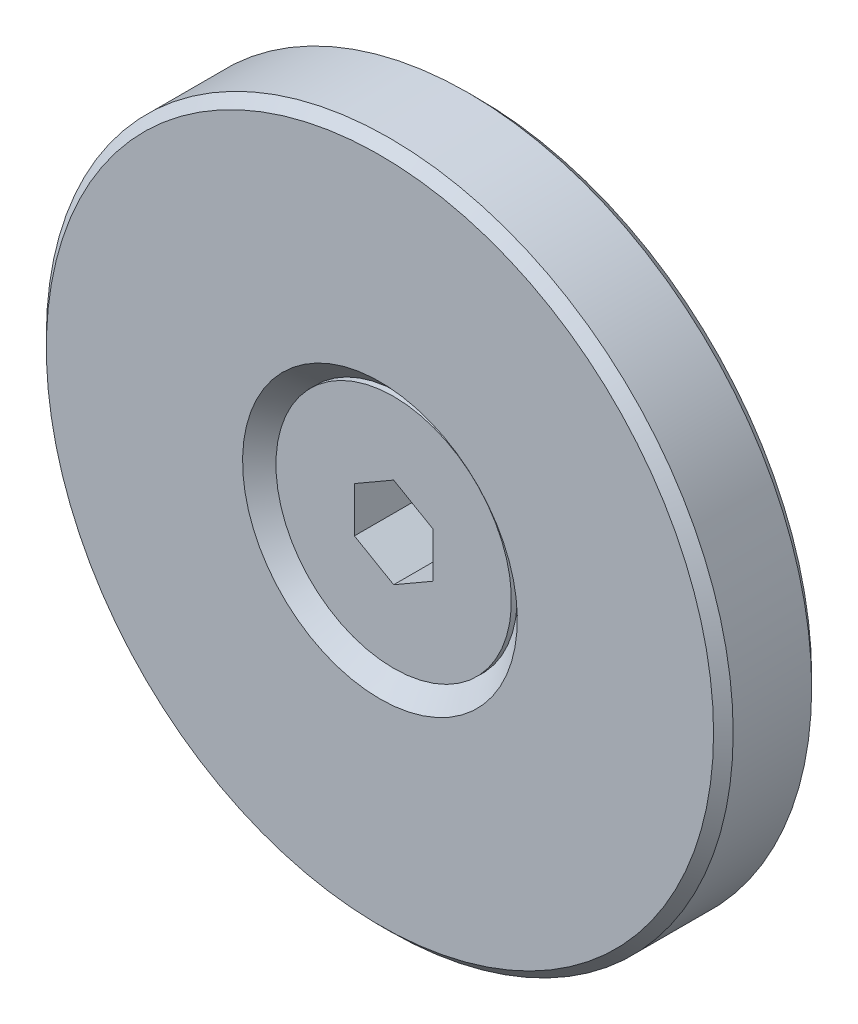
ISO-10303-21;
HEADER;
FILE_DESCRIPTION(('STEP AP214'),'2;1');
FILE_NAME('part.step','',(''),(''),'','','');
FILE_SCHEMA(('AUTOMOTIVE_DESIGN { 1 0 10303 214 1 1 1 1 }'));
ENDSEC;
DATA;
#1=APPLICATION_CONTEXT('core data for automotive mechanical design processes');
#2=APPLICATION_PROTOCOL_DEFINITION('international standard','automotive_design',2000,#1);
#3=PRODUCT_CONTEXT('',#1,'mechanical');
#4=PRODUCT('Part','Part','',(#3));
#5=PRODUCT_RELATED_PRODUCT_CATEGORY('part','',(#4));
#6=PRODUCT_DEFINITION_FORMATION('','',#4);
#7=PRODUCT_DEFINITION_CONTEXT('part definition',#1,'design');
#8=PRODUCT_DEFINITION('design','',#6,#7);
#9=PRODUCT_DEFINITION_SHAPE('','',#8);
#10=(LENGTH_UNIT() NAMED_UNIT(*) SI_UNIT(.MILLI.,.METRE.));
#11=(NAMED_UNIT(*) PLANE_ANGLE_UNIT() SI_UNIT($,.RADIAN.));
#12=(NAMED_UNIT(*) SI_UNIT($,.STERADIAN.) SOLID_ANGLE_UNIT());
#13=UNCERTAINTY_MEASURE_WITH_UNIT(LENGTH_MEASURE(1.E-05),#10,'distance_accuracy_value','');
#14=(GEOMETRIC_REPRESENTATION_CONTEXT(3) GLOBAL_UNCERTAINTY_ASSIGNED_CONTEXT((#13)) GLOBAL_UNIT_ASSIGNED_CONTEXT((#10,
#11,#12)) REPRESENTATION_CONTEXT('',''));
#15=CARTESIAN_POINT('',(0.,0.,0.));
#16=DIRECTION('',(0.,0.,1.));
#17=DIRECTION('',(1.,0.,0.));
#18=AXIS2_PLACEMENT_3D('',#15,#16,#17);
#19=CARTESIAN_POINT('',(0.,2.00000000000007,-7.7));
#20=DIRECTION('',(0.,0.,1.));
#21=DIRECTION('',(0.,-1.,0.));
#22=AXIS2_PLACEMENT_3D('',#19,#20,#21);
#23=PLANE('',#22);
#24=CARTESIAN_POINT('',(0.,0.,-7.7));
#25=DIRECTION('',(0.,0.,1.));
#26=DIRECTION('',(0.,-1.,0.));
#27=AXIS2_PLACEMENT_3D('',#24,#25,#26);
#28=CIRCLE('',#27,2.00000000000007);
#29=CARTESIAN_POINT('',(0.,-2.00000000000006,-7.7));
#30=VERTEX_POINT('',#29);
#31=EDGE_CURVE('E9',#30,#30,#28,.T.);
#32=ORIENTED_EDGE('',*,*,#31,.F.);
#33=EDGE_LOOP('',(#32));
#34=FACE_BOUND('',#33,.T.);
#35=ADVANCED_FACE('F14',(#34),#23,.F.);
#36=CARTESIAN_POINT('',(0.,0.,-7.7));
#37=DIRECTION('',(0.,0.,1.));
#38=DIRECTION('',(0.,-1.,0.));
#39=AXIS2_PLACEMENT_3D('',#36,#37,#38);
#40=CONICAL_SURFACE('',#39,2.00000000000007,0.785398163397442);
#41=CARTESIAN_POINT('',(0.,0.,-6.7));
#42=DIRECTION('',(0.,0.,1.));
#43=DIRECTION('',(0.,-1.,0.));
#44=AXIS2_PLACEMENT_3D('',#41,#42,#43);
#45=CIRCLE('',#44,3.00000000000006);
#46=CARTESIAN_POINT('',(0.,-3.00000000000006,-6.7));
#47=VERTEX_POINT('',#46);
#48=EDGE_CURVE('E21',#47,#47,#45,.T.);
#49=ORIENTED_EDGE('',*,*,#48,.F.);
#50=EDGE_LOOP('',(#49));
#51=FACE_BOUND('',#50,.T.);
#52=ORIENTED_EDGE('',*,*,#31,.T.);
#53=EDGE_LOOP('',(#52));
#54=FACE_BOUND('',#53,.T.);
#55=ADVANCED_FACE('F143',(#51,#54),#40,.T.);
#56=CARTESIAN_POINT('',(0.,0.,10.));
#57=DIRECTION('',(0.,0.,1.));
#58=DIRECTION('',(0.,-1.,0.));
#59=AXIS2_PLACEMENT_3D('',#56,#57,#58);
#60=CYLINDRICAL_SURFACE('',#59,3.00000000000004);
#61=CARTESIAN_POINT('',(0.,0.,1.00000000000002));
#62=DIRECTION('',(0.,0.,1.));
#63=DIRECTION('',(0.,-1.,0.));
#64=AXIS2_PLACEMENT_3D('',#61,#62,#63);
#65=CIRCLE('',#64,3.);
#66=CARTESIAN_POINT('',(0.,-3.,1.00000000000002));
#67=VERTEX_POINT('',#66);
#68=EDGE_CURVE('E136',#67,#67,#65,.T.);
#69=ORIENTED_EDGE('',*,*,#68,.F.);
#70=EDGE_LOOP('',(#69));
#71=FACE_BOUND('',#70,.T.);
#72=ORIENTED_EDGE('',*,*,#48,.T.);
#73=EDGE_LOOP('',(#72));
#74=FACE_BOUND('',#73,.T.);
#75=ADVANCED_FACE('F141',(#71,#74),#60,.T.);
#76=CARTESIAN_POINT('',(0.,0.,1.00000000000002));
#77=DIRECTION('',(0.,0.,1.));
#78=DIRECTION('',(0.,-1.,0.));
#79=AXIS2_PLACEMENT_3D('',#76,#77,#78);
#80=CONICAL_SURFACE('',#79,3.,0.785398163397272);
#81=CARTESIAN_POINT('',(0.,0.,1.19977548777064));
#82=DIRECTION('',(0.,0.,1.));
#83=DIRECTION('',(0.,-1.,0.));
#84=AXIS2_PLACEMENT_3D('',#81,#82,#83);
#85=CIRCLE('',#84,3.19977548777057);
#86=CARTESIAN_POINT('',(0.,-3.19977548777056,1.19977548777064));
#87=VERTEX_POINT('',#86);
#88=EDGE_CURVE('E133',#87,#87,#85,.T.);
#89=ORIENTED_EDGE('',*,*,#88,.F.);
#90=EDGE_LOOP('',(#89));
#91=FACE_BOUND('',#90,.T.);
#92=ORIENTED_EDGE('',*,*,#68,.T.);
#93=EDGE_LOOP('',(#92));
#94=FACE_BOUND('',#93,.T.);
#95=ADVANCED_FACE('F166',(#91,#94),#80,.T.);
#96=CARTESIAN_POINT('',(0.,0.,10.));
#97=DIRECTION('',(0.,0.,1.));
#98=DIRECTION('',(0.,-1.,0.));
#99=AXIS2_PLACEMENT_3D('',#96,#97,#98);
#100=CYLINDRICAL_SURFACE('',#99,3.19977548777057);
#101=CARTESIAN_POINT('',(0.,0.,0.));
#102=DIRECTION('',(0.,0.,1.));
#103=DIRECTION('',(0.,-1.,0.));
#104=AXIS2_PLACEMENT_3D('',#101,#102,#103);
#105=CIRCLE('',#104,3.19977548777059);
#106=CARTESIAN_POINT('',(0.,-3.19977548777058,0.));
#107=VERTEX_POINT('',#106);
#108=EDGE_CURVE('E130',#107,#107,#105,.T.);
#109=ORIENTED_EDGE('',*,*,#108,.F.);
#110=EDGE_LOOP('',(#109));
#111=FACE_BOUND('',#110,.T.);
#112=ORIENTED_EDGE('',*,*,#88,.T.);
#113=EDGE_LOOP('',(#112));
#114=FACE_BOUND('',#113,.T.);
#115=ADVANCED_FACE('F175',(#111,#114),#100,.F.);
#116=CARTESIAN_POINT('',(0.,3.19977548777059,0.));
#117=DIRECTION('',(0.,0.,1.));
#118=DIRECTION('',(0.,-1.,0.));
#119=AXIS2_PLACEMENT_3D('',#116,#117,#118);
#120=PLANE('',#119);
#121=ORIENTED_EDGE('',*,*,#108,.T.);
#122=EDGE_LOOP('',(#121));
#123=FACE_BOUND('',#122,.T.);
#124=CARTESIAN_POINT('',(0.,0.,0.));
#125=DIRECTION('',(0.,0.,1.));
#126=DIRECTION('',(1.,0.,0.));
#127=AXIS2_PLACEMENT_3D('',#124,#125,#126);
#128=CIRCLE('',#127,17.);
#129=CARTESIAN_POINT('',(17.,0.,0.));
#130=VERTEX_POINT('',#129);
#131=EDGE_CURVE('E361',#130,#130,#128,.T.);
#132=ORIENTED_EDGE('',*,*,#131,.F.);
#133=EDGE_LOOP('',(#132));
#134=FACE_BOUND('',#133,.T.);
#135=ADVANCED_FACE('F184',(#123,#134),#120,.F.);
#136=CARTESIAN_POINT('',(0.,0.,4.5000000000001));
#137=DIRECTION('',(0.,0.,-1.));
#138=DIRECTION('',(-1.,0.,0.));
#139=AXIS2_PLACEMENT_3D('',#136,#137,#138);
#140=CONICAL_SURFACE('',#139,17.5,0.785398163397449);
#141=CARTESIAN_POINT('',(0.,0.,5.0000000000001));
#142=DIRECTION('',(0.,0.,1.));
#143=DIRECTION('',(1.,0.,0.));
#144=AXIS2_PLACEMENT_3D('',#141,#142,#143);
#145=CIRCLE('',#144,17.);
#146=CARTESIAN_POINT('',(17.,0.,5.0000000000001));
#147=VERTEX_POINT('',#146);
#148=EDGE_CURVE('E103',#147,#147,#145,.T.);
#149=ORIENTED_EDGE('',*,*,#148,.F.);
#150=EDGE_LOOP('',(#149));
#151=FACE_BOUND('',#150,.T.);
#152=CARTESIAN_POINT('',(0.,0.,4.5000000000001));
#153=DIRECTION('',(0.,0.,1.));
#154=DIRECTION('',(1.,0.,0.));
#155=AXIS2_PLACEMENT_3D('',#152,#153,#154);
#156=CIRCLE('',#155,17.5);
#157=CARTESIAN_POINT('',(17.5,0.,4.5000000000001));
#158=VERTEX_POINT('',#157);
#159=EDGE_CURVE('E344',#158,#158,#156,.T.);
#160=ORIENTED_EDGE('',*,*,#159,.T.);
#161=EDGE_LOOP('',(#160));
#162=FACE_BOUND('',#161,.T.);
#163=ADVANCED_FACE('F193',(#151,#162),#140,.T.);
#164=CARTESIAN_POINT('',(0.,0.,11.5440277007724));
#165=DIRECTION('',(0.,0.,1.));
#166=DIRECTION('',(1.,0.,0.));
#167=AXIS2_PLACEMENT_3D('',#164,#165,#166);
#168=CYLINDRICAL_SURFACE('',#167,17.5);
#169=ORIENTED_EDGE('',*,*,#159,.F.);
#170=EDGE_LOOP('',(#169));
#171=FACE_BOUND('',#170,.T.);
#172=CARTESIAN_POINT('',(0.,0.,0.5));
#173=DIRECTION('',(0.,0.,1.));
#174=DIRECTION('',(1.,0.,0.));
#175=AXIS2_PLACEMENT_3D('',#172,#173,#174);
#176=CIRCLE('',#175,17.5);
#177=CARTESIAN_POINT('',(17.5,0.,0.5));
#178=VERTEX_POINT('',#177);
#179=EDGE_CURVE('E347',#178,#178,#176,.T.);
#180=ORIENTED_EDGE('',*,*,#179,.T.);
#181=EDGE_LOOP('',(#180));
#182=FACE_BOUND('',#181,.T.);
#183=ADVANCED_FACE('F202',(#171,#182),#168,.T.);
#184=CARTESIAN_POINT('',(0.,0.,0.));
#185=DIRECTION('',(0.,0.,1.));
#186=DIRECTION('',(1.,0.,0.));
#187=AXIS2_PLACEMENT_3D('',#184,#185,#186);
#188=CONICAL_SURFACE('',#187,17.,0.785398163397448);
#189=ORIENTED_EDGE('',*,*,#179,.F.);
#190=EDGE_LOOP('',(#189));
#191=FACE_BOUND('',#190,.T.);
#192=ORIENTED_EDGE('',*,*,#131,.T.);
#193=EDGE_LOOP('',(#192));
#194=FACE_BOUND('',#193,.T.);
#195=ADVANCED_FACE('F211',(#191,#194),#188,.T.);
#196=CARTESIAN_POINT('',(0.,2.30940107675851,1.30000000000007));
#197=DIRECTION('',(0.,0.,1.));
#198=DIRECTION('',(0.,-1.,0.));
#199=AXIS2_PLACEMENT_3D('',#196,#197,#198);
#200=PLANE('',#199);
#201=DIRECTION('',(-0.866025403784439,0.5,0.));
#202=VECTOR('',#201,1.);
#203=CARTESIAN_POINT('',(2.,1.15470053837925,1.30000000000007));
#204=LINE('',#203,#202);
#205=CARTESIAN_POINT('',(2.,1.15470053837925,1.30000000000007));
#206=VERTEX_POINT('',#205);
#207=CARTESIAN_POINT('',(0.,2.30940107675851,1.30000000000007));
#208=VERTEX_POINT('',#207);
#209=EDGE_CURVE('E114',#206,#208,#204,.T.);
#210=ORIENTED_EDGE('',*,*,#209,.T.);
#211=DIRECTION('',(-0.866025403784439,-0.5,0.));
#212=VECTOR('',#211,1.);
#213=CARTESIAN_POINT('',(0.,2.30940107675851,1.30000000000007));
#214=LINE('',#213,#212);
#215=CARTESIAN_POINT('',(-2.,1.15470053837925,1.30000000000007));
#216=VERTEX_POINT('',#215);
#217=EDGE_CURVE('E96',#208,#216,#214,.T.);
#218=ORIENTED_EDGE('',*,*,#217,.T.);
#219=DIRECTION('',(0.,-1.,0.));
#220=VECTOR('',#219,1.);
#221=CARTESIAN_POINT('',(-2.,1.15470053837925,1.30000000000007));
#222=LINE('',#221,#220);
#223=CARTESIAN_POINT('',(-2.,-1.15470053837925,1.30000000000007));
#224=VERTEX_POINT('',#223);
#225=EDGE_CURVE('E94',#216,#224,#222,.T.);
#226=ORIENTED_EDGE('',*,*,#225,.T.);
#227=DIRECTION('',(0.866025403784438,-0.5,0.));
#228=VECTOR('',#227,1.);
#229=CARTESIAN_POINT('',(-2.,-1.15470053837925,1.30000000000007));
#230=LINE('',#229,#228);
#231=CARTESIAN_POINT('',(0.,-2.30940107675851,1.30000000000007));
#232=VERTEX_POINT('',#231);
#233=EDGE_CURVE('E73',#224,#232,#230,.T.);
#234=ORIENTED_EDGE('',*,*,#233,.T.);
#235=DIRECTION('',(0.866025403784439,0.5,0.));
#236=VECTOR('',#235,1.);
#237=CARTESIAN_POINT('',(0.,-2.30940107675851,1.30000000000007));
#238=LINE('',#237,#236);
#239=CARTESIAN_POINT('',(2.,-1.15470053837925,1.30000000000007));
#240=VERTEX_POINT('',#239);
#241=EDGE_CURVE('E84',#232,#240,#238,.T.);
#242=ORIENTED_EDGE('',*,*,#241,.T.);
#243=DIRECTION('',(0.,1.,0.));
#244=VECTOR('',#243,1.);
#245=CARTESIAN_POINT('',(2.,-1.15470053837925,1.30000000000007));
#246=LINE('',#245,#244);
#247=EDGE_CURVE('E88',#240,#206,#246,.T.);
#248=ORIENTED_EDGE('',*,*,#247,.T.);
#249=EDGE_LOOP('',(#210,#218,#226,#234,#242,#248));
#250=FACE_BOUND('',#249,.T.);
#251=ADVANCED_FACE('F91',(#250),#200,.T.);
#252=CARTESIAN_POINT('',(-2.,1.15470053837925,1.30000000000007));
#253=DIRECTION('',(-1.,0.,0.));
#254=DIRECTION('',(0.,1.,0.));
#255=AXIS2_PLACEMENT_3D('',#252,#253,#254);
#256=PLANE('',#255);
#257=DIRECTION('',(0.,-1.,0.));
#258=VECTOR('',#257,1.);
#259=CARTESIAN_POINT('',(-2.,1.15470053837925,4.30000000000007));
#260=LINE('',#259,#258);
#261=CARTESIAN_POINT('',(-2.,1.15470053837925,4.30000000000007));
#262=VERTEX_POINT('',#261);
#263=CARTESIAN_POINT('',(-2.,-1.15470053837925,4.30000000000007));
#264=VERTEX_POINT('',#263);
#265=EDGE_CURVE('E106',#262,#264,#260,.T.);
#266=ORIENTED_EDGE('',*,*,#265,.T.);
#267=DIRECTION('',(0.,0.,1.));
#268=VECTOR('',#267,1.);
#269=CARTESIAN_POINT('',(-2.,-1.15470053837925,1.30000000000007));
#270=LINE('',#269,#268);
#271=EDGE_CURVE('E81',#224,#264,#270,.T.);
#272=ORIENTED_EDGE('',*,*,#271,.F.);
#273=ORIENTED_EDGE('',*,*,#225,.F.);
#274=DIRECTION('',(0.,0.,1.));
#275=VECTOR('',#274,1.);
#276=CARTESIAN_POINT('',(-2.,1.15470053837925,1.30000000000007));
#277=LINE('',#276,#275);
#278=EDGE_CURVE('E119',#216,#262,#277,.T.);
#279=ORIENTED_EDGE('',*,*,#278,.T.);
#280=EDGE_LOOP('',(#266,#272,#273,#279));
#281=FACE_BOUND('',#280,.T.);
#282=ADVANCED_FACE('F228',(#281),#256,.F.);
#283=CARTESIAN_POINT('',(-2.,-1.15470053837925,1.30000000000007));
#284=DIRECTION('',(-0.5,-0.866025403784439,0.));
#285=DIRECTION('',(-0.866025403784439,0.5,0.));
#286=AXIS2_PLACEMENT_3D('',#283,#284,#285);
#287=PLANE('',#286);
#288=DIRECTION('',(0.866025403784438,-0.5,0.));
#289=VECTOR('',#288,1.);
#290=CARTESIAN_POINT('',(-2.,-1.15470053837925,4.30000000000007));
#291=LINE('',#290,#289);
#292=CARTESIAN_POINT('',(0.,-2.30940107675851,4.30000000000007));
#293=VERTEX_POINT('',#292);
#294=EDGE_CURVE('E76',#264,#293,#291,.T.);
#295=ORIENTED_EDGE('',*,*,#294,.T.);
#296=DIRECTION('',(0.,0.,1.));
#297=VECTOR('',#296,1.);
#298=CARTESIAN_POINT('',(0.,-2.30940107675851,1.30000000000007));
#299=LINE('',#298,#297);
#300=EDGE_CURVE('E69',#232,#293,#299,.T.);
#301=ORIENTED_EDGE('',*,*,#300,.F.);
#302=ORIENTED_EDGE('',*,*,#233,.F.);
#303=ORIENTED_EDGE('',*,*,#271,.T.);
#304=EDGE_LOOP('',(#295,#301,#302,#303));
#305=FACE_BOUND('',#304,.T.);
#306=ADVANCED_FACE('F71',(#305),#287,.F.);
#307=CARTESIAN_POINT('',(0.,-2.30940107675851,1.30000000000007));
#308=DIRECTION('',(0.5,-0.866025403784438,0.));
#309=DIRECTION('',(-0.866025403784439,-0.5,0.));
#310=AXIS2_PLACEMENT_3D('',#307,#308,#309);
#311=PLANE('',#310);
#312=DIRECTION('',(0.866025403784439,0.5,0.));
#313=VECTOR('',#312,1.);
#314=CARTESIAN_POINT('',(0.,-2.30940107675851,4.30000000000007));
#315=LINE('',#314,#313);
#316=CARTESIAN_POINT('',(2.,-1.15470053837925,4.30000000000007));
#317=VERTEX_POINT('',#316);
#318=EDGE_CURVE('E110',#293,#317,#315,.T.);
#319=ORIENTED_EDGE('',*,*,#318,.T.);
#320=DIRECTION('',(0.,0.,1.));
#321=VECTOR('',#320,1.);
#322=CARTESIAN_POINT('',(2.,-1.15470053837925,1.30000000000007));
#323=LINE('',#322,#321);
#324=EDGE_CURVE('E80',#240,#317,#323,.T.);
#325=ORIENTED_EDGE('',*,*,#324,.F.);
#326=ORIENTED_EDGE('',*,*,#241,.F.);
#327=ORIENTED_EDGE('',*,*,#300,.T.);
#328=EDGE_LOOP('',(#319,#325,#326,#327));
#329=FACE_BOUND('',#328,.T.);
#330=ADVANCED_FACE('F85',(#329),#311,.F.);
#331=CARTESIAN_POINT('',(2.,-1.15470053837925,1.30000000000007));
#332=DIRECTION('',(1.,0.,0.));
#333=DIRECTION('',(0.,-1.,0.));
#334=AXIS2_PLACEMENT_3D('',#331,#332,#333);
#335=PLANE('',#334);
#336=DIRECTION('',(0.,1.,0.));
#337=VECTOR('',#336,1.);
#338=CARTESIAN_POINT('',(2.,-1.15470053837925,4.30000000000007));
#339=LINE('',#338,#337);
#340=CARTESIAN_POINT('',(2.,1.15470053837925,4.30000000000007));
#341=VERTEX_POINT('',#340);
#342=EDGE_CURVE('E112',#317,#341,#339,.T.);
#343=ORIENTED_EDGE('',*,*,#342,.T.);
#344=DIRECTION('',(0.,0.,1.));
#345=VECTOR('',#344,1.);
#346=CARTESIAN_POINT('',(2.,1.15470053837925,1.30000000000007));
#347=LINE('',#346,#345);
#348=EDGE_CURVE('E36',#206,#341,#347,.T.);
#349=ORIENTED_EDGE('',*,*,#348,.F.);
#350=ORIENTED_EDGE('',*,*,#247,.F.);
#351=ORIENTED_EDGE('',*,*,#324,.T.);
#352=EDGE_LOOP('',(#343,#349,#350,#351));
#353=FACE_BOUND('',#352,.T.);
#354=ADVANCED_FACE('F251',(#353),#335,.F.);
#355=CARTESIAN_POINT('',(2.,1.15470053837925,1.30000000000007));
#356=DIRECTION('',(0.5,0.866025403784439,0.));
#357=DIRECTION('',(0.866025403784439,-0.5,0.));
#358=AXIS2_PLACEMENT_3D('',#355,#356,#357);
#359=PLANE('',#358);
#360=DIRECTION('',(-0.866025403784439,0.5,0.));
#361=VECTOR('',#360,1.);
#362=CARTESIAN_POINT('',(2.,1.15470053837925,4.30000000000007));
#363=LINE('',#362,#361);
#364=CARTESIAN_POINT('',(0.,2.30940107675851,4.30000000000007));
#365=VERTEX_POINT('',#364);
#366=EDGE_CURVE('E28',#341,#365,#363,.T.);
#367=ORIENTED_EDGE('',*,*,#366,.T.);
#368=DIRECTION('',(0.,0.,1.));
#369=VECTOR('',#368,1.);
#370=CARTESIAN_POINT('',(0.,2.30940107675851,1.30000000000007));
#371=LINE('',#370,#369);
#372=EDGE_CURVE('E58',#208,#365,#371,.T.);
#373=ORIENTED_EDGE('',*,*,#372,.F.);
#374=ORIENTED_EDGE('',*,*,#209,.F.);
#375=ORIENTED_EDGE('',*,*,#348,.T.);
#376=EDGE_LOOP('',(#367,#373,#374,#375));
#377=FACE_BOUND('',#376,.T.);
#378=ADVANCED_FACE('F259',(#377),#359,.F.);
#379=CARTESIAN_POINT('',(0.,2.30940107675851,1.30000000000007));
#380=DIRECTION('',(-0.5,0.866025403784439,0.));
#381=DIRECTION('',(0.866025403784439,0.5,0.));
#382=AXIS2_PLACEMENT_3D('',#379,#380,#381);
#383=PLANE('',#382);
#384=DIRECTION('',(-0.866025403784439,-0.5,0.));
#385=VECTOR('',#384,1.);
#386=CARTESIAN_POINT('',(0.,2.30940107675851,4.30000000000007));
#387=LINE('',#386,#385);
#388=EDGE_CURVE('E102',#365,#262,#387,.T.);
#389=ORIENTED_EDGE('',*,*,#388,.T.);
#390=ORIENTED_EDGE('',*,*,#278,.F.);
#391=ORIENTED_EDGE('',*,*,#217,.F.);
#392=ORIENTED_EDGE('',*,*,#372,.T.);
#393=EDGE_LOOP('',(#389,#390,#391,#392));
#394=FACE_BOUND('',#393,.T.);
#395=ADVANCED_FACE('F267',(#394),#383,.F.);
#396=CARTESIAN_POINT('',(0.,0.,4.30000000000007));
#397=DIRECTION('',(0.,0.,-1.));
#398=DIRECTION('',(0.,1.,0.));
#399=AXIS2_PLACEMENT_3D('',#396,#397,#398);
#400=PLANE('',#399);
#401=ORIENTED_EDGE('',*,*,#388,.F.);
#402=ORIENTED_EDGE('',*,*,#366,.F.);
#403=ORIENTED_EDGE('',*,*,#342,.F.);
#404=ORIENTED_EDGE('',*,*,#318,.F.);
#405=ORIENTED_EDGE('',*,*,#294,.F.);
#406=ORIENTED_EDGE('',*,*,#265,.F.);
#407=EDGE_LOOP('',(#401,#402,#403,#404,#405,#406));
#408=FACE_BOUND('',#407,.T.);
#409=CARTESIAN_POINT('',(0.,0.,4.3000000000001));
#410=DIRECTION('',(0.,0.,1.));
#411=DIRECTION('',(0.,-1.,0.));
#412=AXIS2_PLACEMENT_3D('',#409,#410,#411);
#413=CIRCLE('',#412,6.);
#414=CARTESIAN_POINT('',(0.,-6.,4.3000000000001));
#415=VERTEX_POINT('',#414);
#416=EDGE_CURVE('E116',#415,#415,#413,.T.);
#417=ORIENTED_EDGE('',*,*,#416,.T.);
#418=EDGE_LOOP('',(#417));
#419=FACE_BOUND('',#418,.T.);
#420=ADVANCED_FACE('F275',(#408,#419),#400,.F.);
#421=CARTESIAN_POINT('',(0.,0.,10.));
#422=DIRECTION('',(0.,0.,1.));
#423=DIRECTION('',(0.,-1.,0.));
#424=AXIS2_PLACEMENT_3D('',#421,#422,#423);
#425=CYLINDRICAL_SURFACE('',#424,6.);
#426=ORIENTED_EDGE('',*,*,#416,.F.);
#427=EDGE_LOOP('',(#426));
#428=FACE_BOUND('',#427,.T.);
#429=CARTESIAN_POINT('',(0.,0.,4.0000000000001));
#430=DIRECTION('',(0.,0.,1.));
#431=DIRECTION('',(0.,-1.,0.));
#432=AXIS2_PLACEMENT_3D('',#429,#430,#431);
#433=CIRCLE('',#432,6.);
#434=CARTESIAN_POINT('',(0.,-6.,4.0000000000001));
#435=VERTEX_POINT('',#434);
#436=EDGE_CURVE('E124',#435,#435,#433,.T.);
#437=ORIENTED_EDGE('',*,*,#436,.T.);
#438=EDGE_LOOP('',(#437));
#439=FACE_BOUND('',#438,.T.);
#440=ADVANCED_FACE('F284',(#428,#439),#425,.T.);
#441=CARTESIAN_POINT('',(0.,0.,5.));
#442=DIRECTION('',(0.,0.,1.));
#443=DIRECTION('',(0.,-1.,0.));
#444=AXIS2_PLACEMENT_3D('',#441,#442,#443);
#445=CONICAL_SURFACE('',#444,7.,0.785398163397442);
#446=ORIENTED_EDGE('',*,*,#436,.F.);
#447=EDGE_LOOP('',(#446));
#448=FACE_BOUND('',#447,.T.);
#449=CARTESIAN_POINT('',(0.,0.,5.));
#450=DIRECTION('',(0.,0.,1.));
#451=DIRECTION('',(0.,-1.,0.));
#452=AXIS2_PLACEMENT_3D('',#449,#450,#451);
#453=CIRCLE('',#452,7.);
#454=CARTESIAN_POINT('',(0.,-7.,5.));
#455=VERTEX_POINT('',#454);
#456=EDGE_CURVE('E127',#455,#455,#453,.T.);
#457=ORIENTED_EDGE('',*,*,#456,.T.);
#458=EDGE_LOOP('',(#457));
#459=FACE_BOUND('',#458,.T.);
#460=ADVANCED_FACE('F293',(#448,#459),#445,.F.);
#461=CARTESIAN_POINT('',(0.,14.5,5.00000000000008));
#462=DIRECTION('',(0.,0.,-1.));
#463=DIRECTION('',(0.,1.,0.));
#464=AXIS2_PLACEMENT_3D('',#461,#462,#463);
#465=PLANE('',#464);
#466=ORIENTED_EDGE('',*,*,#456,.F.);
#467=EDGE_LOOP('',(#466));
#468=FACE_BOUND('',#467,.T.);
#469=ORIENTED_EDGE('',*,*,#148,.T.);
#470=EDGE_LOOP('',(#469));
#471=FACE_BOUND('',#470,.T.);
#472=ADVANCED_FACE('F302',(#468,#471),#465,.F.);
#473=CLOSED_SHELL('',(#35,#55,#75,#95,#115,#135,#163,#183,#195,#251,#282,#306,#330,#354,#378,
#395,#420,#440,#460,#472));
#474=MANIFOLD_SOLID_BREP('B1',#473);
#475=ADVANCED_BREP_SHAPE_REPRESENTATION('',(#18,#474),#14);
#476=SHAPE_DEFINITION_REPRESENTATION(#9,#475);
ENDSEC;
END-ISO-10303-21;
